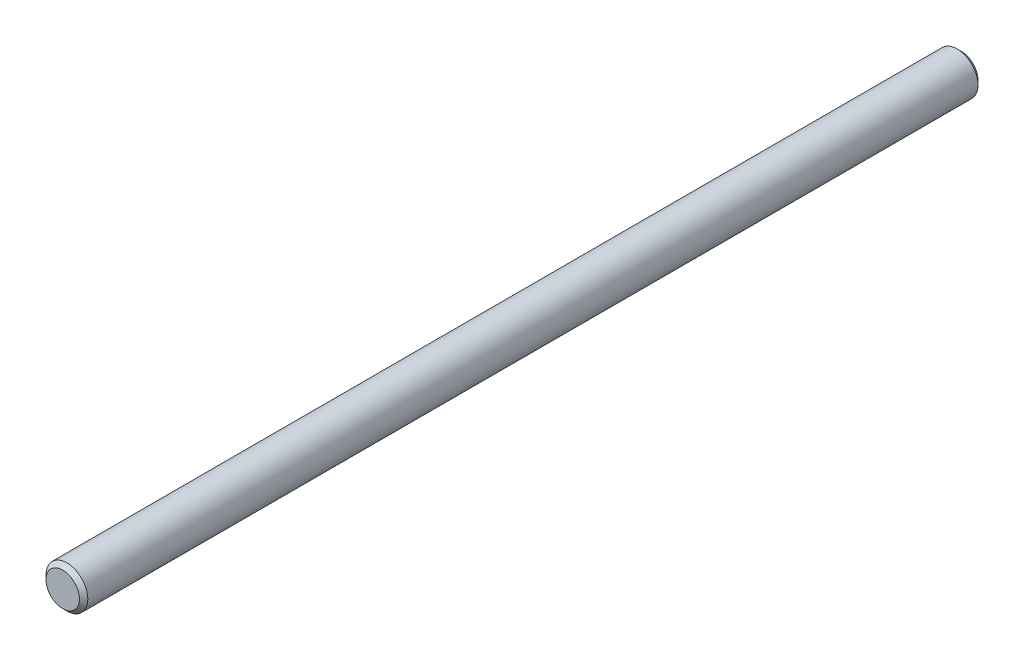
ISO-10303-21;
HEADER;
FILE_DESCRIPTION(('STEP AP214'),'2;1');
FILE_NAME('part.step','',(''),(''),'','','');
FILE_SCHEMA(('AUTOMOTIVE_DESIGN { 1 0 10303 214 1 1 1 1 }'));
ENDSEC;
DATA;
#1=APPLICATION_CONTEXT('core data for automotive mechanical design processes');
#2=APPLICATION_PROTOCOL_DEFINITION('international standard','automotive_design',2000,#1);
#3=PRODUCT_CONTEXT('',#1,'mechanical');
#4=PRODUCT('Part','Part','',(#3));
#5=PRODUCT_RELATED_PRODUCT_CATEGORY('part','',(#4));
#6=PRODUCT_DEFINITION_FORMATION('','',#4);
#7=PRODUCT_DEFINITION_CONTEXT('part definition',#1,'design');
#8=PRODUCT_DEFINITION('design','',#6,#7);
#9=PRODUCT_DEFINITION_SHAPE('','',#8);
#10=(LENGTH_UNIT() NAMED_UNIT(*) SI_UNIT(.MILLI.,.METRE.));
#11=(NAMED_UNIT(*) PLANE_ANGLE_UNIT() SI_UNIT($,.RADIAN.));
#12=(NAMED_UNIT(*) SI_UNIT($,.STERADIAN.) SOLID_ANGLE_UNIT());
#13=UNCERTAINTY_MEASURE_WITH_UNIT(LENGTH_MEASURE(1.E-05),#10,'distance_accuracy_value','');
#14=(GEOMETRIC_REPRESENTATION_CONTEXT(3) GLOBAL_UNCERTAINTY_ASSIGNED_CONTEXT((#13)) GLOBAL_UNIT_ASSIGNED_CONTEXT((#10,
#11,#12)) REPRESENTATION_CONTEXT('',''));
#15=CARTESIAN_POINT('',(0.,0.,0.));
#16=DIRECTION('',(0.,0.,1.));
#17=DIRECTION('',(1.,0.,0.));
#18=AXIS2_PLACEMENT_3D('',#15,#16,#17);
#19=CARTESIAN_POINT('',(0.,0.,21.5));
#20=DIRECTION('',(0.,0.,-1.));
#21=DIRECTION('',(-1.,0.,0.));
#22=AXIS2_PLACEMENT_3D('',#19,#20,#21);
#23=CYLINDRICAL_SURFACE('',#22,0.999999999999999);
#24=CARTESIAN_POINT('',(0.,0.,21.3));
#25=DIRECTION('',(0.,0.,1.));
#26=DIRECTION('',(1.,0.,0.));
#27=AXIS2_PLACEMENT_3D('',#24,#25,#26);
#28=CIRCLE('',#27,0.999999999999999);
#29=CARTESIAN_POINT('',(0.999999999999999,0.,21.3));
#30=VERTEX_POINT('',#29);
#31=EDGE_CURVE('E38',#30,#30,#28,.F.);
#32=ORIENTED_EDGE('',*,*,#31,.T.);
#33=EDGE_LOOP('',(#32));
#34=FACE_BOUND('',#33,.T.);
#35=CARTESIAN_POINT('',(0.,0.,-21.3));
#36=DIRECTION('',(0.,0.,1.));
#37=DIRECTION('',(1.,0.,0.));
#38=AXIS2_PLACEMENT_3D('',#35,#36,#37);
#39=CIRCLE('',#38,0.999999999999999);
#40=CARTESIAN_POINT('',(0.999999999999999,0.,-21.3));
#41=VERTEX_POINT('',#40);
#42=EDGE_CURVE('E42',#41,#41,#39,.T.);
#43=ORIENTED_EDGE('',*,*,#42,.T.);
#44=EDGE_LOOP('',(#43));
#45=FACE_BOUND('',#44,.T.);
#46=ADVANCED_FACE('F32',(#34,#45),#23,.T.);
#47=CARTESIAN_POINT('',(0.,0.,21.5));
#48=DIRECTION('',(0.,0.,1.));
#49=DIRECTION('',(1.,0.,0.));
#50=AXIS2_PLACEMENT_3D('',#47,#48,#49);
#51=PLANE('',#50);
#52=CARTESIAN_POINT('',(0.,0.,21.5));
#53=DIRECTION('',(0.,0.,1.));
#54=DIRECTION('',(1.,0.,0.));
#55=AXIS2_PLACEMENT_3D('',#52,#53,#54);
#56=CIRCLE('',#55,0.8);
#57=CARTESIAN_POINT('',(0.8,0.,21.5));
#58=VERTEX_POINT('',#57);
#59=EDGE_CURVE('E46',#58,#58,#56,.T.);
#60=ORIENTED_EDGE('',*,*,#59,.T.);
#61=EDGE_LOOP('',(#60));
#62=FACE_BOUND('',#61,.T.);
#63=ADVANCED_FACE('F52',(#62),#51,.T.);
#64=CARTESIAN_POINT('',(0.,0.,-21.5));
#65=DIRECTION('',(0.,0.,1.));
#66=DIRECTION('',(1.,0.,0.));
#67=AXIS2_PLACEMENT_3D('',#64,#65,#66);
#68=PLANE('',#67);
#69=CARTESIAN_POINT('',(0.,0.,-21.5));
#70=DIRECTION('',(0.,0.,1.));
#71=DIRECTION('',(1.,0.,0.));
#72=AXIS2_PLACEMENT_3D('',#69,#70,#71);
#73=CIRCLE('',#72,0.799999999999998);
#74=CARTESIAN_POINT('',(0.799999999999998,0.,-21.5));
#75=VERTEX_POINT('',#74);
#76=EDGE_CURVE('E10',#75,#75,#73,.F.);
#77=ORIENTED_EDGE('',*,*,#76,.T.);
#78=EDGE_LOOP('',(#77));
#79=FACE_BOUND('',#78,.T.);
#80=ADVANCED_FACE('F57',(#79),#68,.F.);
#81=CARTESIAN_POINT('',(0.,0.,21.5));
#82=DIRECTION('',(0.,0.,-1.));
#83=DIRECTION('',(-1.,0.,0.));
#84=AXIS2_PLACEMENT_3D('',#81,#82,#83);
#85=CONICAL_SURFACE('',#84,0.8,0.785398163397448);
#86=ORIENTED_EDGE('',*,*,#31,.F.);
#87=EDGE_LOOP('',(#86));
#88=FACE_BOUND('',#87,.T.);
#89=ORIENTED_EDGE('',*,*,#59,.F.);
#90=EDGE_LOOP('',(#89));
#91=FACE_BOUND('',#90,.T.);
#92=ADVANCED_FACE('F54',(#88,#91),#85,.T.);
#93=CARTESIAN_POINT('',(0.,0.,-21.3));
#94=DIRECTION('',(0.,0.,1.));
#95=DIRECTION('',(1.,0.,0.));
#96=AXIS2_PLACEMENT_3D('',#93,#94,#95);
#97=CONICAL_SURFACE('',#96,0.999999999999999,0.785398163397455);
#98=ORIENTED_EDGE('',*,*,#76,.F.);
#99=EDGE_LOOP('',(#98));
#100=FACE_BOUND('',#99,.T.);
#101=ORIENTED_EDGE('',*,*,#42,.F.);
#102=EDGE_LOOP('',(#101));
#103=FACE_BOUND('',#102,.T.);
#104=ADVANCED_FACE('F56',(#100,#103),#97,.T.);
#105=CLOSED_SHELL('',(#46,#63,#80,#92,#104));
#106=MANIFOLD_SOLID_BREP('B2',#105);
#107=ADVANCED_BREP_SHAPE_REPRESENTATION('',(#18,#106),#14);
#108=SHAPE_DEFINITION_REPRESENTATION(#9,#107);
ENDSEC;
END-ISO-10303-21;
